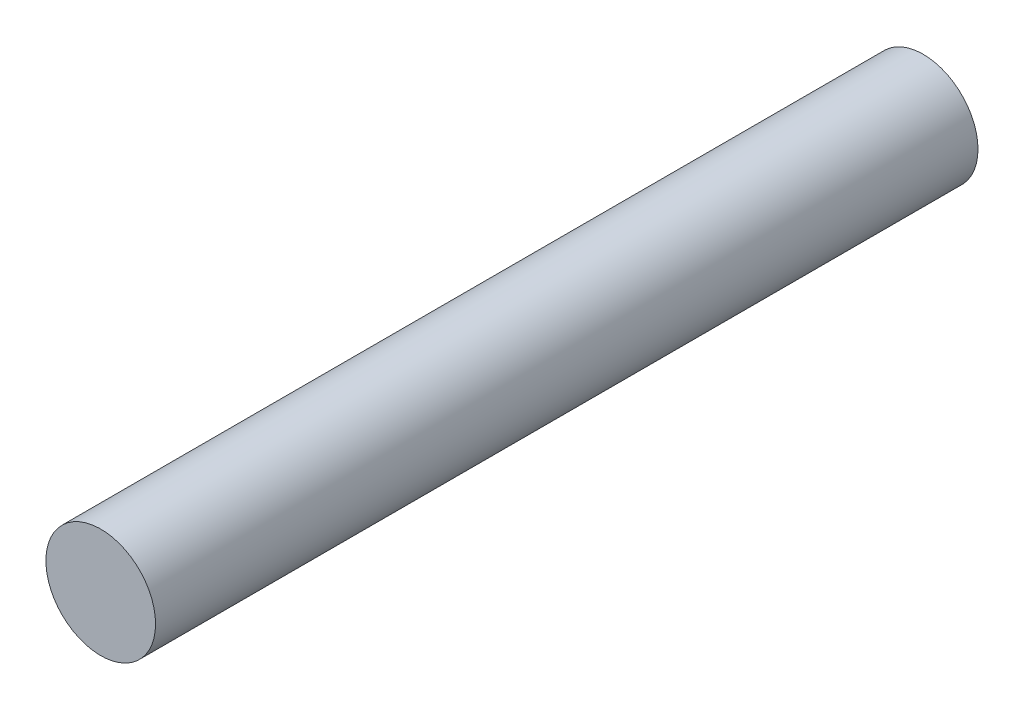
ISO-10303-21;
HEADER;
FILE_DESCRIPTION(('STEP AP214'),'2;1');
FILE_NAME('part.step','',(''),(''),'','','');
FILE_SCHEMA(('AUTOMOTIVE_DESIGN { 1 0 10303 214 1 1 1 1 }'));
ENDSEC;
DATA;
#1=APPLICATION_CONTEXT('core data for automotive mechanical design processes');
#2=APPLICATION_PROTOCOL_DEFINITION('international standard','automotive_design',2000,#1);
#3=PRODUCT_CONTEXT('',#1,'mechanical');
#4=PRODUCT('Part','Part','',(#3));
#5=PRODUCT_RELATED_PRODUCT_CATEGORY('part','',(#4));
#6=PRODUCT_DEFINITION_FORMATION('','',#4);
#7=PRODUCT_DEFINITION_CONTEXT('part definition',#1,'design');
#8=PRODUCT_DEFINITION('design','',#6,#7);
#9=PRODUCT_DEFINITION_SHAPE('','',#8);
#10=(LENGTH_UNIT() NAMED_UNIT(*) SI_UNIT(.MILLI.,.METRE.));
#11=(NAMED_UNIT(*) PLANE_ANGLE_UNIT() SI_UNIT($,.RADIAN.));
#12=(NAMED_UNIT(*) SI_UNIT($,.STERADIAN.) SOLID_ANGLE_UNIT());
#13=UNCERTAINTY_MEASURE_WITH_UNIT(LENGTH_MEASURE(1.E-05),#10,'distance_accuracy_value','');
#14=(GEOMETRIC_REPRESENTATION_CONTEXT(3) GLOBAL_UNCERTAINTY_ASSIGNED_CONTEXT((#13)) GLOBAL_UNIT_ASSIGNED_CONTEXT((#10,
#11,#12)) REPRESENTATION_CONTEXT('',''));
#15=CARTESIAN_POINT('',(0.,0.,0.));
#16=DIRECTION('',(0.,0.,1.));
#17=DIRECTION('',(1.,0.,0.));
#18=AXIS2_PLACEMENT_3D('',#15,#16,#17);
#19=CARTESIAN_POINT('',(0.,0.,-450.));
#20=DIRECTION('',(0.,0.,1.));
#21=DIRECTION('',(1.,0.,0.));
#22=AXIS2_PLACEMENT_3D('',#19,#20,#21);
#23=CYLINDRICAL_SURFACE('',#22,30.);
#24=CARTESIAN_POINT('',(0.,0.,-450.));
#25=DIRECTION('',(0.,0.,1.));
#26=DIRECTION('',(1.,0.,0.));
#27=AXIS2_PLACEMENT_3D('',#24,#25,#26);
#28=CIRCLE('',#27,30.);
#29=CARTESIAN_POINT('',(30.,0.,-450.));
#30=VERTEX_POINT('',#29);
#31=EDGE_CURVE('E10',#30,#30,#28,.T.);
#32=ORIENTED_EDGE('',*,*,#31,.T.);
#33=EDGE_LOOP('',(#32));
#34=FACE_BOUND('',#33,.T.);
#35=CARTESIAN_POINT('',(0.,0.,0.));
#36=DIRECTION('',(0.,0.,1.));
#37=DIRECTION('',(1.,0.,0.));
#38=AXIS2_PLACEMENT_3D('',#35,#36,#37);
#39=CIRCLE('',#38,30.);
#40=CARTESIAN_POINT('',(30.,0.,0.));
#41=VERTEX_POINT('',#40);
#42=EDGE_CURVE('E40',#41,#41,#39,.T.);
#43=ORIENTED_EDGE('',*,*,#42,.F.);
#44=EDGE_LOOP('',(#43));
#45=FACE_BOUND('',#44,.T.);
#46=ADVANCED_FACE('F37',(#34,#45),#23,.T.);
#47=CARTESIAN_POINT('',(0.,0.,-450.));
#48=DIRECTION('',(0.,0.,1.));
#49=DIRECTION('',(1.,0.,0.));
#50=AXIS2_PLACEMENT_3D('',#47,#48,#49);
#51=PLANE('',#50);
#52=ORIENTED_EDGE('',*,*,#31,.F.);
#53=EDGE_LOOP('',(#52));
#54=FACE_BOUND('',#53,.T.);
#55=ADVANCED_FACE('F54',(#54),#51,.F.);
#56=CARTESIAN_POINT('',(0.,0.,0.));
#57=DIRECTION('',(0.,0.,1.));
#58=DIRECTION('',(1.,0.,0.));
#59=AXIS2_PLACEMENT_3D('',#56,#57,#58);
#60=PLANE('',#59);
#61=ORIENTED_EDGE('',*,*,#42,.T.);
#62=EDGE_LOOP('',(#61));
#63=FACE_BOUND('',#62,.T.);
#64=ADVANCED_FACE('F51',(#63),#60,.T.);
#65=CLOSED_SHELL('',(#46,#55,#64));
#66=MANIFOLD_SOLID_BREP('B2',#65);
#67=ADVANCED_BREP_SHAPE_REPRESENTATION('',(#18,#66),#14);
#68=SHAPE_DEFINITION_REPRESENTATION(#9,#67);
ENDSEC;
END-ISO-10303-21;
